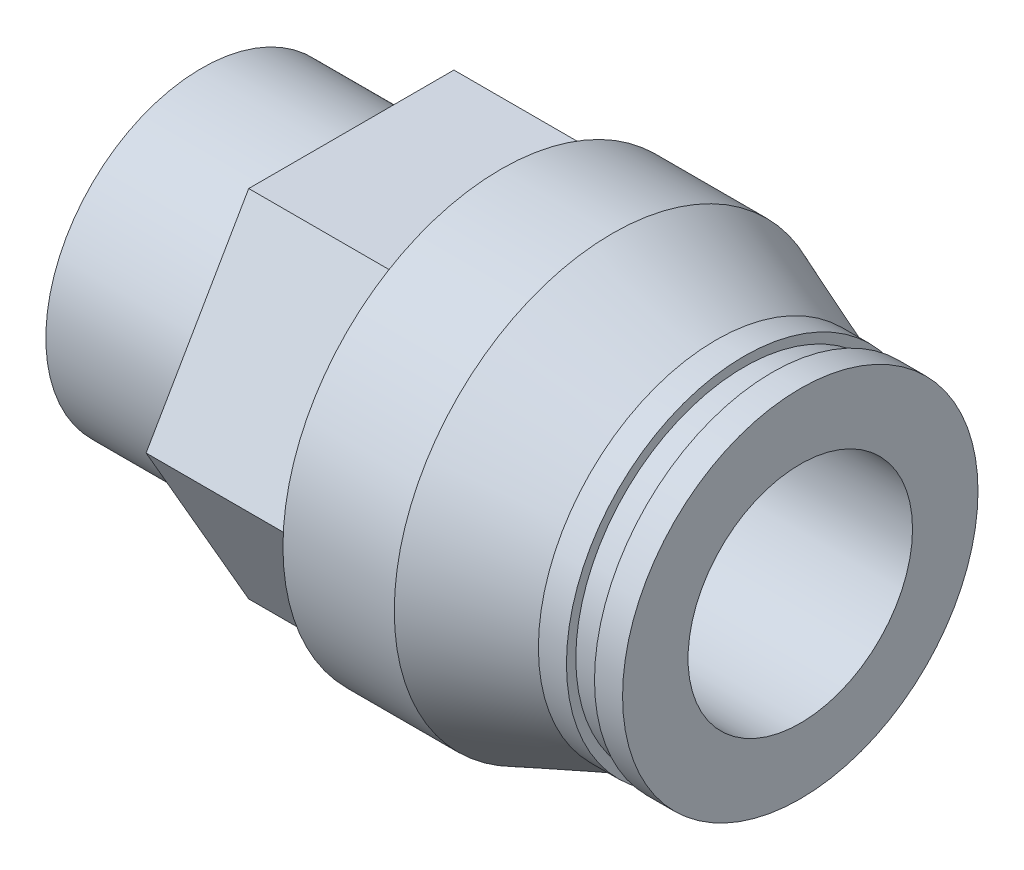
ISO-10303-21;
HEADER;
FILE_DESCRIPTION(('STEP AP214'),'2;1');
FILE_NAME('part.step','',(''),(''),'','','');
FILE_SCHEMA(('AUTOMOTIVE_DESIGN { 1 0 10303 214 1 1 1 1 }'));
ENDSEC;
DATA;
#1=APPLICATION_CONTEXT('core data for automotive mechanical design processes');
#2=APPLICATION_PROTOCOL_DEFINITION('international standard','automotive_design',2000,#1);
#3=PRODUCT_CONTEXT('',#1,'mechanical');
#4=PRODUCT('Part','Part','',(#3));
#5=PRODUCT_RELATED_PRODUCT_CATEGORY('part','',(#4));
#6=PRODUCT_DEFINITION_FORMATION('','',#4);
#7=PRODUCT_DEFINITION_CONTEXT('part definition',#1,'design');
#8=PRODUCT_DEFINITION('design','',#6,#7);
#9=PRODUCT_DEFINITION_SHAPE('','',#8);
#10=(LENGTH_UNIT() NAMED_UNIT(*) SI_UNIT(.MILLI.,.METRE.));
#11=(NAMED_UNIT(*) PLANE_ANGLE_UNIT() SI_UNIT($,.RADIAN.));
#12=(NAMED_UNIT(*) SI_UNIT($,.STERADIAN.) SOLID_ANGLE_UNIT());
#13=UNCERTAINTY_MEASURE_WITH_UNIT(LENGTH_MEASURE(1.E-05),#10,'distance_accuracy_value','');
#14=(GEOMETRIC_REPRESENTATION_CONTEXT(3) GLOBAL_UNCERTAINTY_ASSIGNED_CONTEXT((#13)) GLOBAL_UNIT_ASSIGNED_CONTEXT((#10,
#11,#12)) REPRESENTATION_CONTEXT('',''));
#15=CARTESIAN_POINT('',(0.,0.,0.));
#16=DIRECTION('',(0.,0.,1.));
#17=DIRECTION('',(1.,0.,0.));
#18=AXIS2_PLACEMENT_3D('',#15,#16,#17);
#19=CARTESIAN_POINT('',(8.,8.33,0.));
#20=DIRECTION('',(-1.,0.,0.));
#21=DIRECTION('',(0.,0.,1.));
#22=AXIS2_PLACEMENT_3D('',#19,#20,#21);
#23=PLANE('',#22);
#24=CARTESIAN_POINT('',(8.,0.,0.));
#25=DIRECTION('',(1.,0.,0.));
#26=DIRECTION('',(0.,0.,-1.));
#27=AXIS2_PLACEMENT_3D('',#24,#25,#26);
#28=CIRCLE('',#27,8.33);
#29=CARTESIAN_POINT('',(8.,0.,-8.33));
#30=VERTEX_POINT('',#29);
#31=EDGE_CURVE('E219',#30,#30,#28,.T.);
#32=ORIENTED_EDGE('',*,*,#31,.T.);
#33=EDGE_LOOP('',(#32));
#34=FACE_BOUND('',#33,.T.);
#35=DIRECTION('',(0.,-0.866025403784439,0.5));
#36=VECTOR('',#35,1.);
#37=CARTESIAN_POINT('',(8.,0.,-10.9696551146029));
#38=LINE('',#37,#36);
#39=CARTESIAN_POINT('',(8.,0.,-10.9696551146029));
#40=VERTEX_POINT('',#39);
#41=CARTESIAN_POINT('',(8.,-9.5,-5.48482755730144));
#42=VERTEX_POINT('',#41);
#43=EDGE_CURVE('E128',#40,#42,#38,.T.);
#44=ORIENTED_EDGE('',*,*,#43,.T.);
#45=DIRECTION('',(0.,0.,1.));
#46=VECTOR('',#45,1.);
#47=CARTESIAN_POINT('',(8.,-9.5,-5.48482755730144));
#48=LINE('',#47,#46);
#49=CARTESIAN_POINT('',(8.,-9.5,5.48482755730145));
#50=VERTEX_POINT('',#49);
#51=EDGE_CURVE('E111',#42,#50,#48,.T.);
#52=ORIENTED_EDGE('',*,*,#51,.T.);
#53=DIRECTION('',(0.,0.866025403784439,0.5));
#54=VECTOR('',#53,1.);
#55=CARTESIAN_POINT('',(8.,-9.5,5.48482755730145));
#56=LINE('',#55,#54);
#57=CARTESIAN_POINT('',(8.,0.,10.9696551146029));
#58=VERTEX_POINT('',#57);
#59=EDGE_CURVE('E122',#50,#58,#56,.T.);
#60=ORIENTED_EDGE('',*,*,#59,.T.);
#61=DIRECTION('',(0.,0.866025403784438,-0.5));
#62=VECTOR('',#61,1.);
#63=CARTESIAN_POINT('',(8.,0.,10.9696551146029));
#64=LINE('',#63,#62);
#65=CARTESIAN_POINT('',(8.,9.5,5.48482755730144));
#66=VERTEX_POINT('',#65);
#67=EDGE_CURVE('E31',#58,#66,#64,.T.);
#68=ORIENTED_EDGE('',*,*,#67,.T.);
#69=DIRECTION('',(0.,0.,-1.));
#70=VECTOR('',#69,1.);
#71=CARTESIAN_POINT('',(8.,9.5,5.48482755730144));
#72=LINE('',#71,#70);
#73=CARTESIAN_POINT('',(8.,9.5,-5.48482755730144));
#74=VERTEX_POINT('',#73);
#75=EDGE_CURVE('E132',#66,#74,#72,.T.);
#76=ORIENTED_EDGE('',*,*,#75,.T.);
#77=DIRECTION('',(0.,-0.866025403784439,-0.5));
#78=VECTOR('',#77,1.);
#79=CARTESIAN_POINT('',(8.,9.5,-5.48482755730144));
#80=LINE('',#79,#78);
#81=EDGE_CURVE('E135',#74,#40,#80,.T.);
#82=ORIENTED_EDGE('',*,*,#81,.T.);
#83=EDGE_LOOP('',(#44,#52,#60,#68,#76,#82));
#84=FACE_BOUND('',#83,.T.);
#85=ADVANCED_FACE('F16',(#34,#84),#23,.T.);
#86=CARTESIAN_POINT('',(0.,0.,0.));
#87=DIRECTION('',(-1.,0.,0.));
#88=DIRECTION('',(0.,0.,1.));
#89=AXIS2_PLACEMENT_3D('',#86,#87,#88);
#90=PLANE('',#89);
#91=CARTESIAN_POINT('',(0.,0.,0.));
#92=DIRECTION('',(1.,0.,0.));
#93=DIRECTION('',(0.,0.,-1.));
#94=AXIS2_PLACEMENT_3D('',#91,#92,#93);
#95=CIRCLE('',#94,8.33);
#96=CARTESIAN_POINT('',(0.,0.,-8.33));
#97=VERTEX_POINT('',#96);
#98=EDGE_CURVE('E222',#97,#97,#95,.T.);
#99=ORIENTED_EDGE('',*,*,#98,.F.);
#100=EDGE_LOOP('',(#99));
#101=FACE_BOUND('',#100,.T.);
#102=DIRECTION('',(0.,-0.866025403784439,-0.5));
#103=VECTOR('',#102,1.);
#104=CARTESIAN_POINT('',(0.,0.,4.618802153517));
#105=LINE('',#104,#103);
#106=CARTESIAN_POINT('',(0.,0.,4.618802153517));
#107=VERTEX_POINT('',#106);
#108=CARTESIAN_POINT('',(0.,-4.,2.3094010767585));
#109=VERTEX_POINT('',#108);
#110=EDGE_CURVE('E174',#107,#109,#105,.T.);
#111=ORIENTED_EDGE('',*,*,#110,.T.);
#112=DIRECTION('',(0.,0.,-1.));
#113=VECTOR('',#112,1.);
#114=CARTESIAN_POINT('',(0.,-4.,2.3094010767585));
#115=LINE('',#114,#113);
#116=CARTESIAN_POINT('',(0.,-4.,-2.30940107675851));
#117=VERTEX_POINT('',#116);
#118=EDGE_CURVE('E39',#109,#117,#115,.T.);
#119=ORIENTED_EDGE('',*,*,#118,.T.);
#120=DIRECTION('',(0.,0.866025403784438,-0.5));
#121=VECTOR('',#120,1.);
#122=CARTESIAN_POINT('',(0.,-4.,-2.30940107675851));
#123=LINE('',#122,#121);
#124=CARTESIAN_POINT('',(0.,0.,-4.61880215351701));
#125=VERTEX_POINT('',#124);
#126=EDGE_CURVE('E162',#117,#125,#123,.T.);
#127=ORIENTED_EDGE('',*,*,#126,.T.);
#128=DIRECTION('',(0.,0.866025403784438,0.5));
#129=VECTOR('',#128,1.);
#130=CARTESIAN_POINT('',(0.,0.,-4.61880215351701));
#131=LINE('',#130,#129);
#132=CARTESIAN_POINT('',(0.,4.,-2.3094010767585));
#133=VERTEX_POINT('',#132);
#134=EDGE_CURVE('E165',#125,#133,#131,.T.);
#135=ORIENTED_EDGE('',*,*,#134,.T.);
#136=DIRECTION('',(0.,0.,1.));
#137=VECTOR('',#136,1.);
#138=CARTESIAN_POINT('',(0.,4.,-2.3094010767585));
#139=LINE('',#138,#137);
#140=CARTESIAN_POINT('',(0.,4.,2.3094010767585));
#141=VERTEX_POINT('',#140);
#142=EDGE_CURVE('E168',#133,#141,#139,.T.);
#143=ORIENTED_EDGE('',*,*,#142,.T.);
#144=DIRECTION('',(0.,-0.866025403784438,0.5));
#145=VECTOR('',#144,1.);
#146=CARTESIAN_POINT('',(0.,4.,2.3094010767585));
#147=LINE('',#146,#145);
#148=EDGE_CURVE('E171',#141,#107,#147,.T.);
#149=ORIENTED_EDGE('',*,*,#148,.T.);
#150=EDGE_LOOP('',(#111,#119,#127,#135,#143,#149));
#151=FACE_BOUND('',#150,.T.);
#152=ADVANCED_FACE('F18',(#101,#151),#90,.T.);
#153=CARTESIAN_POINT('',(11.,6.,0.));
#154=DIRECTION('',(1.,0.,0.));
#155=DIRECTION('',(0.,0.,-1.));
#156=AXIS2_PLACEMENT_3D('',#153,#154,#155);
#157=PLANE('',#156);
#158=CARTESIAN_POINT('',(11.,0.,0.));
#159=DIRECTION('',(1.,0.,0.));
#160=DIRECTION('',(0.,0.,-1.));
#161=AXIS2_PLACEMENT_3D('',#158,#159,#160);
#162=CIRCLE('',#161,6.);
#163=CARTESIAN_POINT('',(11.,0.,-6.));
#164=VERTEX_POINT('',#163);
#165=EDGE_CURVE('E189',#164,#164,#162,.T.);
#166=ORIENTED_EDGE('',*,*,#165,.T.);
#167=EDGE_LOOP('',(#166));
#168=FACE_BOUND('',#167,.T.);
#169=DIRECTION('',(0.,-0.866025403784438,0.5));
#170=VECTOR('',#169,1.);
#171=CARTESIAN_POINT('',(11.,2.5,-6.06217782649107));
#172=LINE('',#171,#170);
#173=CARTESIAN_POINT('',(11.,0.,-4.61880215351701));
#174=VERTEX_POINT('',#173);
#175=CARTESIAN_POINT('',(11.,-4.,-2.30940107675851));
#176=VERTEX_POINT('',#175);
#177=EDGE_CURVE('E24',#174,#176,#172,.T.);
#178=ORIENTED_EDGE('',*,*,#177,.T.);
#179=DIRECTION('',(0.,0.,1.));
#180=VECTOR('',#179,1.);
#181=CARTESIAN_POINT('',(11.,-4.,0.));
#182=LINE('',#181,#180);
#183=CARTESIAN_POINT('',(11.,-4.,2.3094010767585));
#184=VERTEX_POINT('',#183);
#185=EDGE_CURVE('E10',#176,#184,#182,.T.);
#186=ORIENTED_EDGE('',*,*,#185,.T.);
#187=DIRECTION('',(0.,0.866025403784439,0.5));
#188=VECTOR('',#187,1.);
#189=CARTESIAN_POINT('',(11.,2.5,6.06217782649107));
#190=LINE('',#189,#188);
#191=CARTESIAN_POINT('',(11.,0.,4.618802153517));
#192=VERTEX_POINT('',#191);
#193=EDGE_CURVE('E225',#184,#192,#190,.T.);
#194=ORIENTED_EDGE('',*,*,#193,.T.);
#195=DIRECTION('',(0.,0.866025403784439,-0.5));
#196=VECTOR('',#195,1.);
#197=CARTESIAN_POINT('',(11.,6.5,0.866025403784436));
#198=LINE('',#197,#196);
#199=CARTESIAN_POINT('',(11.,4.,2.3094010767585));
#200=VERTEX_POINT('',#199);
#201=EDGE_CURVE('E228',#192,#200,#198,.T.);
#202=ORIENTED_EDGE('',*,*,#201,.T.);
#203=DIRECTION('',(0.,0.,-1.));
#204=VECTOR('',#203,1.);
#205=CARTESIAN_POINT('',(11.,4.,0.));
#206=LINE('',#205,#204);
#207=CARTESIAN_POINT('',(11.,4.,-2.3094010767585));
#208=VERTEX_POINT('',#207);
#209=EDGE_CURVE('E231',#200,#208,#206,.T.);
#210=ORIENTED_EDGE('',*,*,#209,.T.);
#211=DIRECTION('',(0.,-0.866025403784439,-0.5));
#212=VECTOR('',#211,1.);
#213=CARTESIAN_POINT('',(11.,6.5,-0.866025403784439));
#214=LINE('',#213,#212);
#215=EDGE_CURVE('E234',#208,#174,#214,.T.);
#216=ORIENTED_EDGE('',*,*,#215,.T.);
#217=EDGE_LOOP('',(#178,#186,#194,#202,#210,#216));
#218=FACE_BOUND('',#217,.T.);
#219=ADVANCED_FACE('F238',(#168,#218),#157,.T.);
#220=CARTESIAN_POINT('',(0.,0.,0.));
#221=DIRECTION('',(1.,0.,0.));
#222=DIRECTION('',(0.,0.,-1.));
#223=AXIS2_PLACEMENT_3D('',#220,#221,#222);
#224=CYLINDRICAL_SURFACE('',#223,8.33);
#225=ORIENTED_EDGE('',*,*,#98,.T.);
#226=EDGE_LOOP('',(#225));
#227=FACE_BOUND('',#226,.T.);
#228=ORIENTED_EDGE('',*,*,#31,.F.);
#229=EDGE_LOOP('',(#228));
#230=FACE_BOUND('',#229,.T.);
#231=ADVANCED_FACE('F279',(#227,#230),#224,.T.);
#232=CARTESIAN_POINT('',(16.,11.5,0.));
#233=DIRECTION('',(-1.,0.,0.));
#234=DIRECTION('',(0.,0.,1.));
#235=AXIS2_PLACEMENT_3D('',#232,#233,#234);
#236=PLANE('',#235);
#237=CARTESIAN_POINT('',(16.,0.,0.));
#238=DIRECTION('',(1.,0.,0.));
#239=DIRECTION('',(0.,0.,-1.));
#240=AXIS2_PLACEMENT_3D('',#237,#238,#239);
#241=CIRCLE('',#240,11.6551075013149);
#242=CARTESIAN_POINT('',(16.,0.,-11.6551075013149));
#243=VERTEX_POINT('',#242);
#244=EDGE_CURVE('E216',#243,#243,#241,.T.);
#245=ORIENTED_EDGE('',*,*,#244,.F.);
#246=EDGE_LOOP('',(#245));
#247=FACE_BOUND('',#246,.T.);
#248=DIRECTION('',(0.,-0.866025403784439,0.5));
#249=VECTOR('',#248,1.);
#250=CARTESIAN_POINT('',(16.,0.,-10.9696551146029));
#251=LINE('',#250,#249);
#252=CARTESIAN_POINT('',(16.,0.,-10.9696551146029));
#253=VERTEX_POINT('',#252);
#254=CARTESIAN_POINT('',(16.,-9.5,-5.48482755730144));
#255=VERTEX_POINT('',#254);
#256=EDGE_CURVE('E119',#253,#255,#251,.T.);
#257=ORIENTED_EDGE('',*,*,#256,.F.);
#258=DIRECTION('',(0.,-0.866025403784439,-0.5));
#259=VECTOR('',#258,1.);
#260=CARTESIAN_POINT('',(16.,9.5,-5.48482755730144));
#261=LINE('',#260,#259);
#262=CARTESIAN_POINT('',(16.,9.5,-5.48482755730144));
#263=VERTEX_POINT('',#262);
#264=EDGE_CURVE('E147',#263,#253,#261,.T.);
#265=ORIENTED_EDGE('',*,*,#264,.F.);
#266=DIRECTION('',(0.,0.,-1.));
#267=VECTOR('',#266,1.);
#268=CARTESIAN_POINT('',(16.,9.5,5.48482755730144));
#269=LINE('',#268,#267);
#270=CARTESIAN_POINT('',(16.,9.5,5.48482755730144));
#271=VERTEX_POINT('',#270);
#272=EDGE_CURVE('E144',#271,#263,#269,.T.);
#273=ORIENTED_EDGE('',*,*,#272,.F.);
#274=DIRECTION('',(0.,0.866025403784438,-0.5));
#275=VECTOR('',#274,1.);
#276=CARTESIAN_POINT('',(16.,0.,10.9696551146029));
#277=LINE('',#276,#275);
#278=CARTESIAN_POINT('',(16.,0.,10.9696551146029));
#279=VERTEX_POINT('',#278);
#280=EDGE_CURVE('E141',#279,#271,#277,.T.);
#281=ORIENTED_EDGE('',*,*,#280,.F.);
#282=DIRECTION('',(0.,0.866025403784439,0.5));
#283=VECTOR('',#282,1.);
#284=CARTESIAN_POINT('',(16.,-9.5,5.48482755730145));
#285=LINE('',#284,#283);
#286=CARTESIAN_POINT('',(16.,-9.5,5.48482755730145));
#287=VERTEX_POINT('',#286);
#288=EDGE_CURVE('E139',#287,#279,#285,.T.);
#289=ORIENTED_EDGE('',*,*,#288,.F.);
#290=DIRECTION('',(0.,0.,1.));
#291=VECTOR('',#290,1.);
#292=CARTESIAN_POINT('',(16.,-9.5,-5.48482755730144));
#293=LINE('',#292,#291);
#294=EDGE_CURVE('E114',#255,#287,#293,.T.);
#295=ORIENTED_EDGE('',*,*,#294,.F.);
#296=EDGE_LOOP('',(#257,#265,#273,#281,#289,#295));
#297=FACE_BOUND('',#296,.T.);
#298=ADVANCED_FACE('F277',(#247,#297),#236,.T.);
#299=CARTESIAN_POINT('',(0.,0.,0.));
#300=DIRECTION('',(1.,0.,0.));
#301=DIRECTION('',(0.,0.,-1.));
#302=AXIS2_PLACEMENT_3D('',#299,#300,#301);
#303=CYLINDRICAL_SURFACE('',#302,11.6551075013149);
#304=ORIENTED_EDGE('',*,*,#244,.T.);
#305=EDGE_LOOP('',(#304));
#306=FACE_BOUND('',#305,.T.);
#307=CARTESIAN_POINT('',(21.9519342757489,0.,0.));
#308=DIRECTION('',(1.,0.,0.));
#309=DIRECTION('',(0.,0.,-1.));
#310=AXIS2_PLACEMENT_3D('',#307,#308,#309);
#311=CIRCLE('',#310,11.6551075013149);
#312=CARTESIAN_POINT('',(21.9519342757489,0.,-11.6551075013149));
#313=VERTEX_POINT('',#312);
#314=EDGE_CURVE('E213',#313,#313,#311,.T.);
#315=ORIENTED_EDGE('',*,*,#314,.F.);
#316=EDGE_LOOP('',(#315));
#317=FACE_BOUND('',#316,.T.);
#318=ADVANCED_FACE('F286',(#306,#317),#303,.T.);
#319=CARTESIAN_POINT('',(27.5,0.,0.));
#320=DIRECTION('',(-1.,0.,0.));
#321=DIRECTION('',(0.,0.,1.));
#322=AXIS2_PLACEMENT_3D('',#319,#320,#321);
#323=CONICAL_SURFACE('',#322,9.5,0.370503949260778);
#324=ORIENTED_EDGE('',*,*,#314,.T.);
#325=EDGE_LOOP('',(#324));
#326=FACE_BOUND('',#325,.T.);
#327=CARTESIAN_POINT('',(27.5,0.,0.));
#328=DIRECTION('',(1.,0.,0.));
#329=DIRECTION('',(0.,0.,-1.));
#330=AXIS2_PLACEMENT_3D('',#327,#328,#329);
#331=CIRCLE('',#330,9.5);
#332=CARTESIAN_POINT('',(27.5,0.,-9.5));
#333=VERTEX_POINT('',#332);
#334=EDGE_CURVE('E210',#333,#333,#331,.T.);
#335=ORIENTED_EDGE('',*,*,#334,.F.);
#336=EDGE_LOOP('',(#335));
#337=FACE_BOUND('',#336,.T.);
#338=ADVANCED_FACE('F317',(#326,#337),#323,.T.);
#339=CARTESIAN_POINT('',(0.,0.,0.));
#340=DIRECTION('',(1.,0.,0.));
#341=DIRECTION('',(0.,0.,-1.));
#342=AXIS2_PLACEMENT_3D('',#339,#340,#341);
#343=CYLINDRICAL_SURFACE('',#342,9.5);
#344=ORIENTED_EDGE('',*,*,#334,.T.);
#345=EDGE_LOOP('',(#344));
#346=FACE_BOUND('',#345,.T.);
#347=CARTESIAN_POINT('',(29.,0.,0.));
#348=DIRECTION('',(1.,0.,0.));
#349=DIRECTION('',(0.,0.,-1.));
#350=AXIS2_PLACEMENT_3D('',#347,#348,#349);
#351=CIRCLE('',#350,9.5);
#352=CARTESIAN_POINT('',(29.,0.,-9.5));
#353=VERTEX_POINT('',#352);
#354=EDGE_CURVE('E207',#353,#353,#351,.T.);
#355=ORIENTED_EDGE('',*,*,#354,.F.);
#356=EDGE_LOOP('',(#355));
#357=FACE_BOUND('',#356,.T.);
#358=ADVANCED_FACE('F313',(#346,#357),#343,.T.);
#359=CARTESIAN_POINT('',(29.,9.5,0.));
#360=DIRECTION('',(1.,0.,0.));
#361=DIRECTION('',(0.,0.,-1.));
#362=AXIS2_PLACEMENT_3D('',#359,#360,#361);
#363=PLANE('',#362);
#364=ORIENTED_EDGE('',*,*,#354,.T.);
#365=EDGE_LOOP('',(#364));
#366=FACE_BOUND('',#365,.T.);
#367=CARTESIAN_POINT('',(29.,0.,0.));
#368=DIRECTION('',(1.,0.,0.));
#369=DIRECTION('',(0.,0.,-1.));
#370=AXIS2_PLACEMENT_3D('',#367,#368,#369);
#371=CIRCLE('',#370,9.);
#372=CARTESIAN_POINT('',(29.,0.,-9.));
#373=VERTEX_POINT('',#372);
#374=EDGE_CURVE('E204',#373,#373,#371,.T.);
#375=ORIENTED_EDGE('',*,*,#374,.F.);
#376=EDGE_LOOP('',(#375));
#377=FACE_BOUND('',#376,.T.);
#378=ADVANCED_FACE('F309',(#366,#377),#363,.T.);
#379=CARTESIAN_POINT('',(0.,0.,0.));
#380=DIRECTION('',(1.,0.,0.));
#381=DIRECTION('',(0.,0.,-1.));
#382=AXIS2_PLACEMENT_3D('',#379,#380,#381);
#383=CYLINDRICAL_SURFACE('',#382,9.);
#384=ORIENTED_EDGE('',*,*,#374,.T.);
#385=EDGE_LOOP('',(#384));
#386=FACE_BOUND('',#385,.T.);
#387=CARTESIAN_POINT('',(30.5,0.,0.));
#388=DIRECTION('',(1.,0.,0.));
#389=DIRECTION('',(0.,0.,-1.));
#390=AXIS2_PLACEMENT_3D('',#387,#388,#389);
#391=CIRCLE('',#390,9.);
#392=CARTESIAN_POINT('',(30.5,0.,-9.));
#393=VERTEX_POINT('',#392);
#394=EDGE_CURVE('E201',#393,#393,#391,.T.);
#395=ORIENTED_EDGE('',*,*,#394,.F.);
#396=EDGE_LOOP('',(#395));
#397=FACE_BOUND('',#396,.T.);
#398=ADVANCED_FACE('F305',(#386,#397),#383,.T.);
#399=CARTESIAN_POINT('',(30.5,9.,0.));
#400=DIRECTION('',(-1.,0.,0.));
#401=DIRECTION('',(0.,0.,1.));
#402=AXIS2_PLACEMENT_3D('',#399,#400,#401);
#403=PLANE('',#402);
#404=ORIENTED_EDGE('',*,*,#394,.T.);
#405=EDGE_LOOP('',(#404));
#406=FACE_BOUND('',#405,.T.);
#407=CARTESIAN_POINT('',(30.5,0.,0.));
#408=DIRECTION('',(1.,0.,0.));
#409=DIRECTION('',(0.,0.,-1.));
#410=AXIS2_PLACEMENT_3D('',#407,#408,#409);
#411=CIRCLE('',#410,9.5);
#412=CARTESIAN_POINT('',(30.5,0.,-9.5));
#413=VERTEX_POINT('',#412);
#414=EDGE_CURVE('E198',#413,#413,#411,.T.);
#415=ORIENTED_EDGE('',*,*,#414,.F.);
#416=EDGE_LOOP('',(#415));
#417=FACE_BOUND('',#416,.T.);
#418=ADVANCED_FACE('F301',(#406,#417),#403,.T.);
#419=CARTESIAN_POINT('',(0.,0.,0.));
#420=DIRECTION('',(1.,0.,0.));
#421=DIRECTION('',(0.,0.,-1.));
#422=AXIS2_PLACEMENT_3D('',#419,#420,#421);
#423=CYLINDRICAL_SURFACE('',#422,9.5);
#424=ORIENTED_EDGE('',*,*,#414,.T.);
#425=EDGE_LOOP('',(#424));
#426=FACE_BOUND('',#425,.T.);
#427=CARTESIAN_POINT('',(32.,0.,0.));
#428=DIRECTION('',(1.,0.,0.));
#429=DIRECTION('',(0.,0.,-1.));
#430=AXIS2_PLACEMENT_3D('',#427,#428,#429);
#431=CIRCLE('',#430,9.5);
#432=CARTESIAN_POINT('',(32.,0.,-9.5));
#433=VERTEX_POINT('',#432);
#434=EDGE_CURVE('E195',#433,#433,#431,.T.);
#435=ORIENTED_EDGE('',*,*,#434,.F.);
#436=EDGE_LOOP('',(#435));
#437=FACE_BOUND('',#436,.T.);
#438=ADVANCED_FACE('F297',(#426,#437),#423,.T.);
#439=CARTESIAN_POINT('',(32.,9.5,0.));
#440=DIRECTION('',(1.,0.,0.));
#441=DIRECTION('',(0.,0.,-1.));
#442=AXIS2_PLACEMENT_3D('',#439,#440,#441);
#443=PLANE('',#442);
#444=ORIENTED_EDGE('',*,*,#434,.T.);
#445=EDGE_LOOP('',(#444));
#446=FACE_BOUND('',#445,.T.);
#447=CARTESIAN_POINT('',(32.,0.,0.));
#448=DIRECTION('',(1.,0.,0.));
#449=DIRECTION('',(0.,0.,-1.));
#450=AXIS2_PLACEMENT_3D('',#447,#448,#449);
#451=CIRCLE('',#450,6.);
#452=CARTESIAN_POINT('',(32.,0.,-6.));
#453=VERTEX_POINT('',#452);
#454=EDGE_CURVE('E192',#453,#453,#451,.T.);
#455=ORIENTED_EDGE('',*,*,#454,.F.);
#456=EDGE_LOOP('',(#455));
#457=FACE_BOUND('',#456,.T.);
#458=ADVANCED_FACE('F265',(#446,#457),#443,.T.);
#459=CARTESIAN_POINT('',(0.,0.,0.));
#460=DIRECTION('',(1.,0.,0.));
#461=DIRECTION('',(0.,0.,-1.));
#462=AXIS2_PLACEMENT_3D('',#459,#460,#461);
#463=CYLINDRICAL_SURFACE('',#462,6.);
#464=ORIENTED_EDGE('',*,*,#454,.T.);
#465=EDGE_LOOP('',(#464));
#466=FACE_BOUND('',#465,.T.);
#467=ORIENTED_EDGE('',*,*,#165,.F.);
#468=EDGE_LOOP('',(#467));
#469=FACE_BOUND('',#468,.T.);
#470=ADVANCED_FACE('F257',(#466,#469),#463,.F.);
#471=CARTESIAN_POINT('',(32.,-4.,2.3094010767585));
#472=DIRECTION('',(0.,1.,0.));
#473=DIRECTION('',(0.,0.,1.));
#474=AXIS2_PLACEMENT_3D('',#471,#472,#473);
#475=PLANE('',#474);
#476=DIRECTION('',(-1.,0.,0.));
#477=VECTOR('',#476,1.);
#478=CARTESIAN_POINT('',(32.,-4.,-2.30940107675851));
#479=LINE('',#478,#477);
#480=EDGE_CURVE('E187',#176,#117,#479,.T.);
#481=ORIENTED_EDGE('',*,*,#480,.T.);
#482=ORIENTED_EDGE('',*,*,#118,.F.);
#483=DIRECTION('',(-1.,0.,0.));
#484=VECTOR('',#483,1.);
#485=CARTESIAN_POINT('',(32.,-4.,2.3094010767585));
#486=LINE('',#485,#484);
#487=EDGE_CURVE('E177',#184,#109,#486,.T.);
#488=ORIENTED_EDGE('',*,*,#487,.F.);
#489=ORIENTED_EDGE('',*,*,#185,.F.);
#490=EDGE_LOOP('',(#481,#482,#488,#489));
#491=FACE_BOUND('',#490,.T.);
#492=ADVANCED_FACE('F255',(#491),#475,.T.);
#493=CARTESIAN_POINT('',(32.,-4.,-2.30940107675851));
#494=DIRECTION('',(0.,0.5,0.866025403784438));
#495=DIRECTION('',(0.,-0.866025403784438,0.5));
#496=AXIS2_PLACEMENT_3D('',#493,#494,#495);
#497=PLANE('',#496);
#498=DIRECTION('',(-1.,0.,0.));
#499=VECTOR('',#498,1.);
#500=CARTESIAN_POINT('',(32.,0.,-4.61880215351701));
#501=LINE('',#500,#499);
#502=EDGE_CURVE('E185',#174,#125,#501,.T.);
#503=ORIENTED_EDGE('',*,*,#502,.T.);
#504=ORIENTED_EDGE('',*,*,#126,.F.);
#505=ORIENTED_EDGE('',*,*,#480,.F.);
#506=ORIENTED_EDGE('',*,*,#177,.F.);
#507=EDGE_LOOP('',(#503,#504,#505,#506));
#508=FACE_BOUND('',#507,.T.);
#509=ADVANCED_FACE('F242',(#508),#497,.T.);
#510=CARTESIAN_POINT('',(32.,0.,-4.61880215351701));
#511=DIRECTION('',(0.,-0.5,0.866025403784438));
#512=DIRECTION('',(0.,-0.866025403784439,-0.5));
#513=AXIS2_PLACEMENT_3D('',#510,#511,#512);
#514=PLANE('',#513);
#515=DIRECTION('',(-1.,0.,0.));
#516=VECTOR('',#515,1.);
#517=CARTESIAN_POINT('',(32.,4.,-2.3094010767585));
#518=LINE('',#517,#516);
#519=EDGE_CURVE('E183',#208,#133,#518,.T.);
#520=ORIENTED_EDGE('',*,*,#519,.T.);
#521=ORIENTED_EDGE('',*,*,#134,.F.);
#522=ORIENTED_EDGE('',*,*,#502,.F.);
#523=ORIENTED_EDGE('',*,*,#215,.F.);
#524=EDGE_LOOP('',(#520,#521,#522,#523));
#525=FACE_BOUND('',#524,.T.);
#526=ADVANCED_FACE('F246',(#525),#514,.T.);
#527=CARTESIAN_POINT('',(32.,4.,-2.3094010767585));
#528=DIRECTION('',(0.,-1.,0.));
#529=DIRECTION('',(0.,0.,-1.));
#530=AXIS2_PLACEMENT_3D('',#527,#528,#529);
#531=PLANE('',#530);
#532=DIRECTION('',(-1.,0.,0.));
#533=VECTOR('',#532,1.);
#534=CARTESIAN_POINT('',(32.,4.,2.3094010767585));
#535=LINE('',#534,#533);
#536=EDGE_CURVE('E181',#200,#141,#535,.T.);
#537=ORIENTED_EDGE('',*,*,#536,.T.);
#538=ORIENTED_EDGE('',*,*,#142,.F.);
#539=ORIENTED_EDGE('',*,*,#519,.F.);
#540=ORIENTED_EDGE('',*,*,#209,.F.);
#541=EDGE_LOOP('',(#537,#538,#539,#540));
#542=FACE_BOUND('',#541,.T.);
#543=ADVANCED_FACE('F374',(#542),#531,.T.);
#544=CARTESIAN_POINT('',(32.,4.,2.3094010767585));
#545=DIRECTION('',(0.,-0.5,-0.866025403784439));
#546=DIRECTION('',(0.,0.866025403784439,-0.5));
#547=AXIS2_PLACEMENT_3D('',#544,#545,#546);
#548=PLANE('',#547);
#549=DIRECTION('',(-1.,0.,0.));
#550=VECTOR('',#549,1.);
#551=CARTESIAN_POINT('',(32.,0.,4.618802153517));
#552=LINE('',#551,#550);
#553=EDGE_CURVE('E179',#192,#107,#552,.T.);
#554=ORIENTED_EDGE('',*,*,#553,.T.);
#555=ORIENTED_EDGE('',*,*,#148,.F.);
#556=ORIENTED_EDGE('',*,*,#536,.F.);
#557=ORIENTED_EDGE('',*,*,#201,.F.);
#558=EDGE_LOOP('',(#554,#555,#556,#557));
#559=FACE_BOUND('',#558,.T.);
#560=ADVANCED_FACE('F371',(#559),#548,.T.);
#561=CARTESIAN_POINT('',(32.,0.,4.618802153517));
#562=DIRECTION('',(0.,0.5,-0.866025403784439));
#563=DIRECTION('',(0.,0.866025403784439,0.5));
#564=AXIS2_PLACEMENT_3D('',#561,#562,#563);
#565=PLANE('',#564);
#566=ORIENTED_EDGE('',*,*,#487,.T.);
#567=ORIENTED_EDGE('',*,*,#110,.F.);
#568=ORIENTED_EDGE('',*,*,#553,.F.);
#569=ORIENTED_EDGE('',*,*,#193,.F.);
#570=EDGE_LOOP('',(#566,#567,#568,#569));
#571=FACE_BOUND('',#570,.T.);
#572=ADVANCED_FACE('F253',(#571),#565,.T.);
#573=CARTESIAN_POINT('',(16.,-9.5,-5.48482755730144));
#574=DIRECTION('',(0.,-1.,0.));
#575=DIRECTION('',(0.,0.,-1.));
#576=AXIS2_PLACEMENT_3D('',#573,#574,#575);
#577=PLANE('',#576);
#578=DIRECTION('',(-1.,0.,0.));
#579=VECTOR('',#578,1.);
#580=CARTESIAN_POINT('',(16.,-9.5,-5.48482755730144));
#581=LINE('',#580,#579);
#582=EDGE_CURVE('E152',#255,#42,#581,.T.);
#583=ORIENTED_EDGE('',*,*,#582,.F.);
#584=ORIENTED_EDGE('',*,*,#294,.T.);
#585=DIRECTION('',(-1.,0.,0.));
#586=VECTOR('',#585,1.);
#587=CARTESIAN_POINT('',(16.,-9.5,5.48482755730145));
#588=LINE('',#587,#586);
#589=EDGE_CURVE('E107',#287,#50,#588,.T.);
#590=ORIENTED_EDGE('',*,*,#589,.T.);
#591=ORIENTED_EDGE('',*,*,#51,.F.);
#592=EDGE_LOOP('',(#583,#584,#590,#591));
#593=FACE_BOUND('',#592,.T.);
#594=ADVANCED_FACE('F109',(#593),#577,.T.);
#595=CARTESIAN_POINT('',(16.,0.,-10.9696551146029));
#596=DIRECTION('',(0.,-0.5,-0.866025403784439));
#597=DIRECTION('',(0.,0.866025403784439,-0.5));
#598=AXIS2_PLACEMENT_3D('',#595,#596,#597);
#599=PLANE('',#598);
#600=DIRECTION('',(-1.,0.,0.));
#601=VECTOR('',#600,1.);
#602=CARTESIAN_POINT('',(16.,0.,-10.9696551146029));
#603=LINE('',#602,#601);
#604=EDGE_CURVE('E154',#253,#40,#603,.T.);
#605=ORIENTED_EDGE('',*,*,#604,.F.);
#606=ORIENTED_EDGE('',*,*,#256,.T.);
#607=ORIENTED_EDGE('',*,*,#582,.T.);
#608=ORIENTED_EDGE('',*,*,#43,.F.);
#609=EDGE_LOOP('',(#605,#606,#607,#608));
#610=FACE_BOUND('',#609,.T.);
#611=ADVANCED_FACE('F368',(#610),#599,.T.);
#612=CARTESIAN_POINT('',(16.,9.5,-5.48482755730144));
#613=DIRECTION('',(0.,0.5,-0.866025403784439));
#614=DIRECTION('',(0.,0.866025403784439,0.5));
#615=AXIS2_PLACEMENT_3D('',#612,#613,#614);
#616=PLANE('',#615);
#617=DIRECTION('',(-1.,0.,0.));
#618=VECTOR('',#617,1.);
#619=CARTESIAN_POINT('',(16.,9.5,-5.48482755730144));
#620=LINE('',#619,#618);
#621=EDGE_CURVE('E156',#263,#74,#620,.T.);
#622=ORIENTED_EDGE('',*,*,#621,.F.);
#623=ORIENTED_EDGE('',*,*,#264,.T.);
#624=ORIENTED_EDGE('',*,*,#604,.T.);
#625=ORIENTED_EDGE('',*,*,#81,.F.);
#626=EDGE_LOOP('',(#622,#623,#624,#625));
#627=FACE_BOUND('',#626,.T.);
#628=ADVANCED_FACE('F350',(#627),#616,.T.);
#629=CARTESIAN_POINT('',(16.,9.5,5.48482755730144));
#630=DIRECTION('',(0.,1.,0.));
#631=DIRECTION('',(0.,0.,1.));
#632=AXIS2_PLACEMENT_3D('',#629,#630,#631);
#633=PLANE('',#632);
#634=DIRECTION('',(-1.,0.,0.));
#635=VECTOR('',#634,1.);
#636=CARTESIAN_POINT('',(16.,9.5,5.48482755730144));
#637=LINE('',#636,#635);
#638=EDGE_CURVE('E158',#271,#66,#637,.T.);
#639=ORIENTED_EDGE('',*,*,#638,.F.);
#640=ORIENTED_EDGE('',*,*,#272,.T.);
#641=ORIENTED_EDGE('',*,*,#621,.T.);
#642=ORIENTED_EDGE('',*,*,#75,.F.);
#643=EDGE_LOOP('',(#639,#640,#641,#642));
#644=FACE_BOUND('',#643,.T.);
#645=ADVANCED_FACE('F354',(#644),#633,.T.);
#646=CARTESIAN_POINT('',(16.,0.,10.9696551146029));
#647=DIRECTION('',(0.,0.5,0.866025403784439));
#648=DIRECTION('',(0.,-0.866025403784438,0.5));
#649=AXIS2_PLACEMENT_3D('',#646,#647,#648);
#650=PLANE('',#649);
#651=DIRECTION('',(-1.,0.,0.));
#652=VECTOR('',#651,1.);
#653=CARTESIAN_POINT('',(16.,0.,10.9696551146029));
#654=LINE('',#653,#652);
#655=EDGE_CURVE('E118',#279,#58,#654,.T.);
#656=ORIENTED_EDGE('',*,*,#655,.F.);
#657=ORIENTED_EDGE('',*,*,#280,.T.);
#658=ORIENTED_EDGE('',*,*,#638,.T.);
#659=ORIENTED_EDGE('',*,*,#67,.F.);
#660=EDGE_LOOP('',(#656,#657,#658,#659));
#661=FACE_BOUND('',#660,.T.);
#662=ADVANCED_FACE('F355',(#661),#650,.T.);
#663=CARTESIAN_POINT('',(16.,-9.5,5.48482755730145));
#664=DIRECTION('',(0.,-0.5,0.866025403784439));
#665=DIRECTION('',(0.,-0.866025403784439,-0.5));
#666=AXIS2_PLACEMENT_3D('',#663,#664,#665);
#667=PLANE('',#666);
#668=ORIENTED_EDGE('',*,*,#589,.F.);
#669=ORIENTED_EDGE('',*,*,#288,.T.);
#670=ORIENTED_EDGE('',*,*,#655,.T.);
#671=ORIENTED_EDGE('',*,*,#59,.F.);
#672=EDGE_LOOP('',(#668,#669,#670,#671));
#673=FACE_BOUND('',#672,.T.);
#674=ADVANCED_FACE('F123',(#673),#667,.T.);
#675=CLOSED_SHELL('',(#85,#152,#219,#231,#298,#318,#338,#358,#378,#398,#418,#438,#458,#470,#492,
#509,#526,#543,#560,#572,#594,#611,#628,#645,#662,#674));
#676=MANIFOLD_SOLID_BREP('B1',#675);
#677=ADVANCED_BREP_SHAPE_REPRESENTATION('',(#18,#676),#14);
#678=SHAPE_DEFINITION_REPRESENTATION(#9,#677);
ENDSEC;
END-ISO-10303-21;
